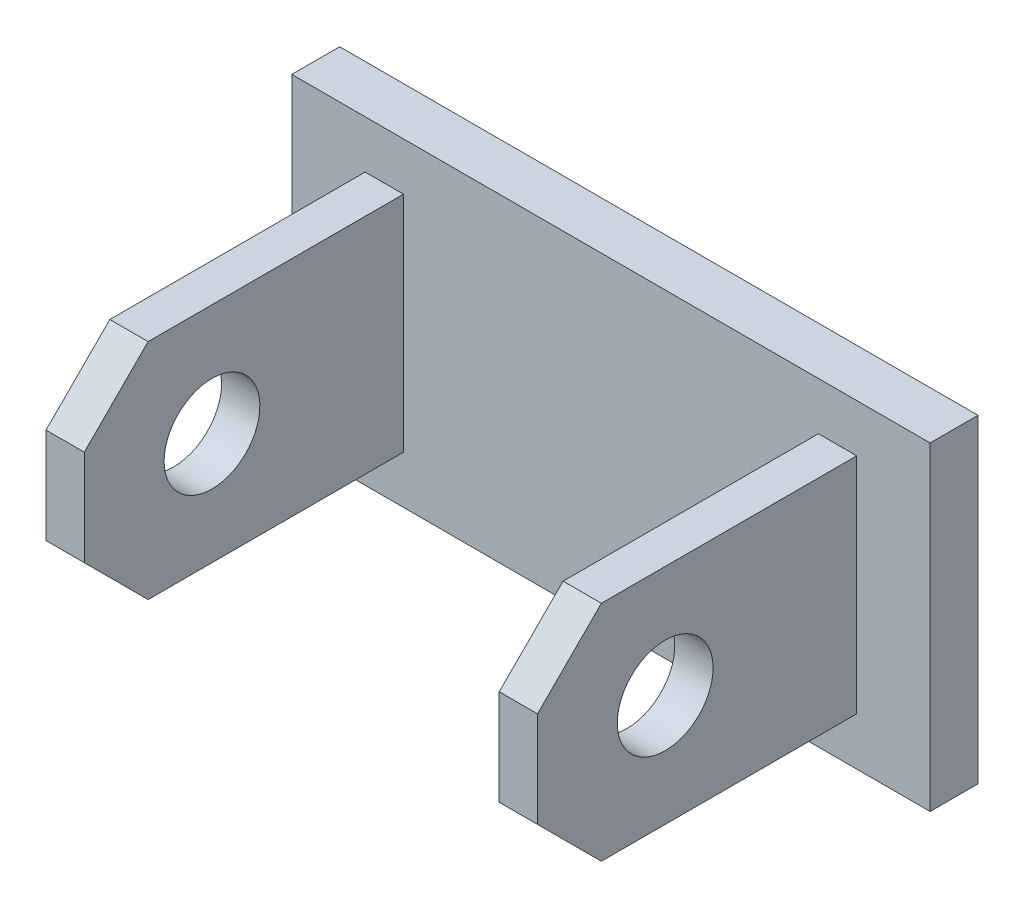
ISO-10303-21;
HEADER;
FILE_DESCRIPTION(('STEP AP214'),'2;1');
FILE_NAME('part.step','',(''),(''),'','','');
FILE_SCHEMA(('AUTOMOTIVE_DESIGN { 1 0 10303 214 1 1 1 1 }'));
ENDSEC;
DATA;
#1=APPLICATION_CONTEXT('core data for automotive mechanical design processes');
#2=APPLICATION_PROTOCOL_DEFINITION('international standard','automotive_design',2000,#1);
#3=PRODUCT_CONTEXT('',#1,'mechanical');
#4=PRODUCT('Part','Part','',(#3));
#5=PRODUCT_RELATED_PRODUCT_CATEGORY('part','',(#4));
#6=PRODUCT_DEFINITION_FORMATION('','',#4);
#7=PRODUCT_DEFINITION_CONTEXT('part definition',#1,'design');
#8=PRODUCT_DEFINITION('design','',#6,#7);
#9=PRODUCT_DEFINITION_SHAPE('','',#8);
#10=(LENGTH_UNIT() NAMED_UNIT(*) SI_UNIT(.MILLI.,.METRE.));
#11=(NAMED_UNIT(*) PLANE_ANGLE_UNIT() SI_UNIT($,.RADIAN.));
#12=(NAMED_UNIT(*) SI_UNIT($,.STERADIAN.) SOLID_ANGLE_UNIT());
#13=UNCERTAINTY_MEASURE_WITH_UNIT(LENGTH_MEASURE(1.E-05),#10,'distance_accuracy_value','');
#14=(GEOMETRIC_REPRESENTATION_CONTEXT(3) GLOBAL_UNCERTAINTY_ASSIGNED_CONTEXT((#13)) GLOBAL_UNIT_ASSIGNED_CONTEXT((#10,
#11,#12)) REPRESENTATION_CONTEXT('',''));
#15=CARTESIAN_POINT('',(0.,0.,0.));
#16=DIRECTION('',(0.,0.,1.));
#17=DIRECTION('',(1.,0.,0.));
#18=AXIS2_PLACEMENT_3D('',#15,#16,#17);
#19=CARTESIAN_POINT('',(77.,35.,115.));
#20=DIRECTION('',(-1.,0.,0.));
#21=DIRECTION('',(0.,1.,0.));
#22=AXIS2_PLACEMENT_3D('',#19,#20,#21);
#23=PLANE('',#22);
#24=CARTESIAN_POINT('',(77.,0.,75.));
#25=DIRECTION('',(-1.,0.,0.));
#26=DIRECTION('',(0.,-1.,0.));
#27=AXIS2_PLACEMENT_3D('',#24,#25,#26);
#28=CIRCLE('',#27,15.);
#29=CARTESIAN_POINT('',(77.,-15.,75.));
#30=VERTEX_POINT('',#29);
#31=EDGE_CURVE('E149',#30,#30,#28,.T.);
#32=ORIENTED_EDGE('',*,*,#31,.T.);
#33=EDGE_LOOP('',(#32));
#34=FACE_BOUND('',#33,.T.);
#35=DIRECTION('',(0.,0.,-1.));
#36=VECTOR('',#35,1.);
#37=CARTESIAN_POINT('',(77.,-35.,115.));
#38=LINE('',#37,#36);
#39=CARTESIAN_POINT('',(77.,-35.,94.9999999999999));
#40=VERTEX_POINT('',#39);
#41=CARTESIAN_POINT('',(77.,-35.,15.));
#42=VERTEX_POINT('',#41);
#43=EDGE_CURVE('E104',#40,#42,#38,.T.);
#44=ORIENTED_EDGE('',*,*,#43,.T.);
#45=DIRECTION('',(0.,-1.,0.));
#46=VECTOR('',#45,1.);
#47=CARTESIAN_POINT('',(77.,35.,15.));
#48=LINE('',#47,#46);
#49=CARTESIAN_POINT('',(77.,35.,15.));
#50=VERTEX_POINT('',#49);
#51=EDGE_CURVE('E110',#50,#42,#48,.T.);
#52=ORIENTED_EDGE('',*,*,#51,.F.);
#53=DIRECTION('',(0.,0.,-1.));
#54=VECTOR('',#53,1.);
#55=CARTESIAN_POINT('',(77.,35.,115.));
#56=LINE('',#55,#54);
#57=CARTESIAN_POINT('',(77.,35.,94.9999999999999));
#58=VERTEX_POINT('',#57);
#59=EDGE_CURVE('E145',#58,#50,#56,.T.);
#60=ORIENTED_EDGE('',*,*,#59,.F.);
#61=DIRECTION('',(0.,0.707106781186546,-0.707106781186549));
#62=VECTOR('',#61,1.);
#63=CARTESIAN_POINT('',(77.,15.,115.));
#64=LINE('',#63,#62);
#65=CARTESIAN_POINT('',(77.,15.,115.));
#66=VERTEX_POINT('',#65);
#67=EDGE_CURVE('E134',#66,#58,#64,.T.);
#68=ORIENTED_EDGE('',*,*,#67,.F.);
#69=DIRECTION('',(0.,-1.,0.));
#70=VECTOR('',#69,1.);
#71=CARTESIAN_POINT('',(77.,35.,115.));
#72=LINE('',#71,#70);
#73=CARTESIAN_POINT('',(77.,-15.,115.));
#74=VERTEX_POINT('',#73);
#75=EDGE_CURVE('E140',#66,#74,#72,.T.);
#76=ORIENTED_EDGE('',*,*,#75,.T.);
#77=DIRECTION('',(0.,0.707106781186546,0.707106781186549));
#78=VECTOR('',#77,1.);
#79=CARTESIAN_POINT('',(77.,-15.,115.));
#80=LINE('',#79,#78);
#81=EDGE_CURVE('E54',#40,#74,#80,.T.);
#82=ORIENTED_EDGE('',*,*,#81,.F.);
#83=EDGE_LOOP('',(#44,#52,#60,#68,#76,#82));
#84=FACE_BOUND('',#83,.T.);
#85=ADVANCED_FACE('F45',(#34,#84),#23,.F.);
#86=CARTESIAN_POINT('',(77.,-35.,115.));
#87=DIRECTION('',(0.,1.,0.));
#88=DIRECTION('',(0.,0.,1.));
#89=AXIS2_PLACEMENT_3D('',#86,#87,#88);
#90=PLANE('',#89);
#91=DIRECTION('',(0.,0.,-1.));
#92=VECTOR('',#91,1.);
#93=CARTESIAN_POINT('',(65.,-35.,115.));
#94=LINE('',#93,#92);
#95=CARTESIAN_POINT('',(65.,-35.,94.9999999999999));
#96=VERTEX_POINT('',#95);
#97=CARTESIAN_POINT('',(65.,-35.,15.));
#98=VERTEX_POINT('',#97);
#99=EDGE_CURVE('E106',#96,#98,#94,.T.);
#100=ORIENTED_EDGE('',*,*,#99,.T.);
#101=DIRECTION('',(-1.,0.,0.));
#102=VECTOR('',#101,1.);
#103=CARTESIAN_POINT('',(77.,-35.,15.));
#104=LINE('',#103,#102);
#105=EDGE_CURVE('E100',#42,#98,#104,.T.);
#106=ORIENTED_EDGE('',*,*,#105,.F.);
#107=ORIENTED_EDGE('',*,*,#43,.F.);
#108=DIRECTION('',(1.,0.,0.));
#109=VECTOR('',#108,1.);
#110=CARTESIAN_POINT('',(77.,-35.,94.9999999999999));
#111=LINE('',#110,#109);
#112=EDGE_CURVE('E67',#96,#40,#111,.T.);
#113=ORIENTED_EDGE('',*,*,#112,.F.);
#114=EDGE_LOOP('',(#100,#106,#107,#113));
#115=FACE_BOUND('',#114,.T.);
#116=ADVANCED_FACE('F102',(#115),#90,.F.);
#117=CARTESIAN_POINT('',(65.,35.,115.));
#118=DIRECTION('',(1.,0.,0.));
#119=DIRECTION('',(0.,0.,1.));
#120=AXIS2_PLACEMENT_3D('',#117,#118,#119);
#121=PLANE('',#120);
#122=CARTESIAN_POINT('',(65.,0.,75.));
#123=DIRECTION('',(-1.,0.,0.));
#124=DIRECTION('',(0.,0.,1.));
#125=AXIS2_PLACEMENT_3D('',#122,#123,#124);
#126=CIRCLE('',#125,15.);
#127=CARTESIAN_POINT('',(65.,0.,90.));
#128=VERTEX_POINT('',#127);
#129=EDGE_CURVE('E49',#128,#128,#126,.T.);
#130=ORIENTED_EDGE('',*,*,#129,.F.);
#131=EDGE_LOOP('',(#130));
#132=FACE_BOUND('',#131,.T.);
#133=DIRECTION('',(0.,1.,0.));
#134=VECTOR('',#133,1.);
#135=CARTESIAN_POINT('',(65.,35.,115.));
#136=LINE('',#135,#134);
#137=CARTESIAN_POINT('',(65.,-15.,115.));
#138=VERTEX_POINT('',#137);
#139=CARTESIAN_POINT('',(65.,15.,115.));
#140=VERTEX_POINT('',#139);
#141=EDGE_CURVE('E142',#138,#140,#136,.T.);
#142=ORIENTED_EDGE('',*,*,#141,.T.);
#143=DIRECTION('',(0.,-0.707106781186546,0.707106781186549));
#144=VECTOR('',#143,1.);
#145=CARTESIAN_POINT('',(65.,15.,115.));
#146=LINE('',#145,#144);
#147=CARTESIAN_POINT('',(65.,35.,94.9999999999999));
#148=VERTEX_POINT('',#147);
#149=EDGE_CURVE('E128',#148,#140,#146,.T.);
#150=ORIENTED_EDGE('',*,*,#149,.F.);
#151=DIRECTION('',(0.,0.,-1.));
#152=VECTOR('',#151,1.);
#153=CARTESIAN_POINT('',(65.,35.,115.));
#154=LINE('',#153,#152);
#155=CARTESIAN_POINT('',(65.,35.,15.));
#156=VERTEX_POINT('',#155);
#157=EDGE_CURVE('E123',#148,#156,#154,.T.);
#158=ORIENTED_EDGE('',*,*,#157,.T.);
#159=DIRECTION('',(0.,1.,0.));
#160=VECTOR('',#159,1.);
#161=CARTESIAN_POINT('',(65.,35.,15.));
#162=LINE('',#161,#160);
#163=EDGE_CURVE('E109',#98,#156,#162,.T.);
#164=ORIENTED_EDGE('',*,*,#163,.F.);
#165=ORIENTED_EDGE('',*,*,#99,.F.);
#166=DIRECTION('',(0.,-0.707106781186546,-0.707106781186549));
#167=VECTOR('',#166,1.);
#168=CARTESIAN_POINT('',(65.,-15.,115.));
#169=LINE('',#168,#167);
#170=EDGE_CURVE('E131',#138,#96,#169,.T.);
#171=ORIENTED_EDGE('',*,*,#170,.F.);
#172=EDGE_LOOP('',(#142,#150,#158,#164,#165,#171));
#173=FACE_BOUND('',#172,.T.);
#174=ADVANCED_FACE('F155',(#132,#173),#121,.F.);
#175=CARTESIAN_POINT('',(77.,35.,115.));
#176=DIRECTION('',(0.,-1.,0.));
#177=DIRECTION('',(0.,0.,-1.));
#178=AXIS2_PLACEMENT_3D('',#175,#176,#177);
#179=PLANE('',#178);
#180=ORIENTED_EDGE('',*,*,#59,.T.);
#181=DIRECTION('',(1.,0.,0.));
#182=VECTOR('',#181,1.);
#183=CARTESIAN_POINT('',(77.,35.,15.));
#184=LINE('',#183,#182);
#185=EDGE_CURVE('E114',#156,#50,#184,.T.);
#186=ORIENTED_EDGE('',*,*,#185,.F.);
#187=ORIENTED_EDGE('',*,*,#157,.F.);
#188=DIRECTION('',(-1.,0.,0.));
#189=VECTOR('',#188,1.);
#190=CARTESIAN_POINT('',(65.,35.,94.9999999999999));
#191=LINE('',#190,#189);
#192=EDGE_CURVE('E12',#58,#148,#191,.T.);
#193=ORIENTED_EDGE('',*,*,#192,.F.);
#194=EDGE_LOOP('',(#180,#186,#187,#193));
#195=FACE_BOUND('',#194,.T.);
#196=ADVANCED_FACE('F156',(#195),#179,.F.);
#197=CARTESIAN_POINT('',(0.,0.,115.));
#198=DIRECTION('',(0.,0.,1.));
#199=DIRECTION('',(-1.,0.,0.));
#200=AXIS2_PLACEMENT_3D('',#197,#198,#199);
#201=PLANE('',#200);
#202=ORIENTED_EDGE('',*,*,#75,.F.);
#203=DIRECTION('',(1.,0.,0.));
#204=VECTOR('',#203,1.);
#205=CARTESIAN_POINT('',(77.,15.,115.));
#206=LINE('',#205,#204);
#207=EDGE_CURVE('E119',#140,#66,#206,.T.);
#208=ORIENTED_EDGE('',*,*,#207,.F.);
#209=ORIENTED_EDGE('',*,*,#141,.F.);
#210=DIRECTION('',(-1.,0.,0.));
#211=VECTOR('',#210,1.);
#212=CARTESIAN_POINT('',(65.,-15.,115.));
#213=LINE('',#212,#211);
#214=EDGE_CURVE('E121',#74,#138,#213,.T.);
#215=ORIENTED_EDGE('',*,*,#214,.F.);
#216=EDGE_LOOP('',(#202,#208,#209,#215));
#217=FACE_BOUND('',#216,.T.);
#218=ADVANCED_FACE('F158',(#217),#201,.T.);
#219=CARTESIAN_POINT('',(0.,0.,15.));
#220=DIRECTION('',(0.,0.,1.));
#221=DIRECTION('',(-1.,0.,0.));
#222=AXIS2_PLACEMENT_3D('',#219,#220,#221);
#223=PLANE('',#222);
#224=ORIENTED_EDGE('',*,*,#51,.T.);
#225=ORIENTED_EDGE('',*,*,#105,.T.);
#226=ORIENTED_EDGE('',*,*,#163,.T.);
#227=ORIENTED_EDGE('',*,*,#185,.T.);
#228=EDGE_LOOP('',(#224,#225,#226,#227));
#229=FACE_BOUND('',#228,.T.);
#230=ADVANCED_FACE('F113',(#229),#223,.F.);
#231=CARTESIAN_POINT('',(0.,-15.,115.));
#232=DIRECTION('',(0.,-0.707106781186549,0.707106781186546));
#233=DIRECTION('',(1.,0.,0.));
#234=AXIS2_PLACEMENT_3D('',#231,#232,#233);
#235=PLANE('',#234);
#236=ORIENTED_EDGE('',*,*,#81,.T.);
#237=ORIENTED_EDGE('',*,*,#214,.T.);
#238=ORIENTED_EDGE('',*,*,#170,.T.);
#239=ORIENTED_EDGE('',*,*,#112,.T.);
#240=EDGE_LOOP('',(#236,#237,#238,#239));
#241=FACE_BOUND('',#240,.T.);
#242=ADVANCED_FACE('F136',(#241),#235,.T.);
#243=CARTESIAN_POINT('',(0.,15.,115.));
#244=DIRECTION('',(0.,0.707106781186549,0.707106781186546));
#245=DIRECTION('',(-1.,0.,0.));
#246=AXIS2_PLACEMENT_3D('',#243,#244,#245);
#247=PLANE('',#246);
#248=ORIENTED_EDGE('',*,*,#149,.T.);
#249=ORIENTED_EDGE('',*,*,#207,.T.);
#250=ORIENTED_EDGE('',*,*,#67,.T.);
#251=ORIENTED_EDGE('',*,*,#192,.T.);
#252=EDGE_LOOP('',(#248,#249,#250,#251));
#253=FACE_BOUND('',#252,.T.);
#254=ADVANCED_FACE('F47',(#253),#247,.T.);
#255=CARTESIAN_POINT('',(-100.,0.,75.));
#256=DIRECTION('',(1.,0.,0.));
#257=DIRECTION('',(0.,-1.,0.));
#258=AXIS2_PLACEMENT_3D('',#255,#256,#257);
#259=CYLINDRICAL_SURFACE('',#258,15.);
#260=ORIENTED_EDGE('',*,*,#31,.F.);
#261=EDGE_LOOP('',(#260));
#262=FACE_BOUND('',#261,.T.);
#263=ORIENTED_EDGE('',*,*,#129,.T.);
#264=EDGE_LOOP('',(#263));
#265=FACE_BOUND('',#264,.T.);
#266=ADVANCED_FACE('F181',(#262,#265),#259,.F.);
#267=CLOSED_SHELL('',(#85,#116,#174,#196,#218,#230,#242,#254,#266));
#268=MANIFOLD_SOLID_BREP('B2',#267);
#269=CARTESIAN_POINT('',(-77.,35.,115.));
#270=DIRECTION('',(1.,0.,0.));
#271=DIRECTION('',(0.,1.,0.));
#272=AXIS2_PLACEMENT_3D('',#269,#270,#271);
#273=PLANE('',#272);
#274=CARTESIAN_POINT('',(-77.,0.,75.));
#275=DIRECTION('',(-1.,0.,0.));
#276=DIRECTION('',(0.,-1.,0.));
#277=AXIS2_PLACEMENT_3D('',#274,#275,#276);
#278=CIRCLE('',#277,15.);
#279=CARTESIAN_POINT('',(-77.,-15.,75.));
#280=VERTEX_POINT('',#279);
#281=EDGE_CURVE('E324',#280,#280,#278,.T.);
#282=ORIENTED_EDGE('',*,*,#281,.F.);
#283=EDGE_LOOP('',(#282));
#284=FACE_BOUND('',#283,.T.);
#285=DIRECTION('',(0.,0.,-1.));
#286=VECTOR('',#285,1.);
#287=CARTESIAN_POINT('',(-77.,-35.,115.));
#288=LINE('',#287,#286);
#289=CARTESIAN_POINT('',(-77.,-35.,94.9999999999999));
#290=VERTEX_POINT('',#289);
#291=CARTESIAN_POINT('',(-77.,-35.,15.));
#292=VERTEX_POINT('',#291);
#293=EDGE_CURVE('E302',#290,#292,#288,.T.);
#294=ORIENTED_EDGE('',*,*,#293,.F.);
#295=DIRECTION('',(0.,0.707106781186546,0.707106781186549));
#296=VECTOR('',#295,1.);
#297=CARTESIAN_POINT('',(-77.,-15.,115.));
#298=LINE('',#297,#296);
#299=CARTESIAN_POINT('',(-77.,-15.,115.));
#300=VERTEX_POINT('',#299);
#301=EDGE_CURVE('E259',#290,#300,#298,.T.);
#302=ORIENTED_EDGE('',*,*,#301,.T.);
#303=DIRECTION('',(0.,-1.,0.));
#304=VECTOR('',#303,1.);
#305=CARTESIAN_POINT('',(-77.,35.,115.));
#306=LINE('',#305,#304);
#307=CARTESIAN_POINT('',(-77.,15.,115.));
#308=VERTEX_POINT('',#307);
#309=EDGE_CURVE('E332',#308,#300,#306,.T.);
#310=ORIENTED_EDGE('',*,*,#309,.F.);
#311=DIRECTION('',(0.,0.707106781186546,-0.707106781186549));
#312=VECTOR('',#311,1.);
#313=CARTESIAN_POINT('',(-77.,15.,115.));
#314=LINE('',#313,#312);
#315=CARTESIAN_POINT('',(-77.,35.,94.9999999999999));
#316=VERTEX_POINT('',#315);
#317=EDGE_CURVE('E266',#308,#316,#314,.T.);
#318=ORIENTED_EDGE('',*,*,#317,.T.);
#319=DIRECTION('',(0.,0.,-1.));
#320=VECTOR('',#319,1.);
#321=CARTESIAN_POINT('',(-77.,35.,115.));
#322=LINE('',#321,#320);
#323=CARTESIAN_POINT('',(-77.,35.,15.));
#324=VERTEX_POINT('',#323);
#325=EDGE_CURVE('E320',#316,#324,#322,.T.);
#326=ORIENTED_EDGE('',*,*,#325,.T.);
#327=DIRECTION('',(0.,-1.,0.));
#328=VECTOR('',#327,1.);
#329=CARTESIAN_POINT('',(-77.,35.,15.));
#330=LINE('',#329,#328);
#331=EDGE_CURVE('E316',#324,#292,#330,.T.);
#332=ORIENTED_EDGE('',*,*,#331,.T.);
#333=EDGE_LOOP('',(#294,#302,#310,#318,#326,#332));
#334=FACE_BOUND('',#333,.T.);
#335=ADVANCED_FACE('F250',(#284,#334),#273,.F.);
#336=CARTESIAN_POINT('',(-77.,-35.,115.));
#337=DIRECTION('',(0.,1.,0.));
#338=DIRECTION('',(0.,0.,1.));
#339=AXIS2_PLACEMENT_3D('',#336,#337,#338);
#340=PLANE('',#339);
#341=DIRECTION('',(0.,0.,-1.));
#342=VECTOR('',#341,1.);
#343=CARTESIAN_POINT('',(-65.,-35.,115.));
#344=LINE('',#343,#342);
#345=CARTESIAN_POINT('',(-65.,-35.,94.9999999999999));
#346=VERTEX_POINT('',#345);
#347=CARTESIAN_POINT('',(-65.,-35.,15.));
#348=VERTEX_POINT('',#347);
#349=EDGE_CURVE('E310',#346,#348,#344,.T.);
#350=ORIENTED_EDGE('',*,*,#349,.F.);
#351=DIRECTION('',(-1.,0.,0.));
#352=VECTOR('',#351,1.);
#353=CARTESIAN_POINT('',(-77.,-35.,94.9999999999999));
#354=LINE('',#353,#352);
#355=EDGE_CURVE('E274',#346,#290,#354,.T.);
#356=ORIENTED_EDGE('',*,*,#355,.T.);
#357=ORIENTED_EDGE('',*,*,#293,.T.);
#358=DIRECTION('',(1.,0.,0.));
#359=VECTOR('',#358,1.);
#360=CARTESIAN_POINT('',(-77.,-35.,15.));
#361=LINE('',#360,#359);
#362=EDGE_CURVE('E305',#292,#348,#361,.T.);
#363=ORIENTED_EDGE('',*,*,#362,.T.);
#364=EDGE_LOOP('',(#350,#356,#357,#363));
#365=FACE_BOUND('',#364,.T.);
#366=ADVANCED_FACE('F304',(#365),#340,.F.);
#367=CARTESIAN_POINT('',(-65.,35.,115.));
#368=DIRECTION('',(-1.,0.,0.));
#369=DIRECTION('',(0.,0.,1.));
#370=AXIS2_PLACEMENT_3D('',#367,#368,#369);
#371=PLANE('',#370);
#372=CARTESIAN_POINT('',(-65.,0.,75.));
#373=DIRECTION('',(-1.,0.,0.));
#374=DIRECTION('',(0.,0.,1.));
#375=AXIS2_PLACEMENT_3D('',#372,#373,#374);
#376=CIRCLE('',#375,15.);
#377=CARTESIAN_POINT('',(-65.,0.,90.));
#378=VERTEX_POINT('',#377);
#379=EDGE_CURVE('E254',#378,#378,#376,.T.);
#380=ORIENTED_EDGE('',*,*,#379,.T.);
#381=EDGE_LOOP('',(#380));
#382=FACE_BOUND('',#381,.T.);
#383=DIRECTION('',(0.,1.,0.));
#384=VECTOR('',#383,1.);
#385=CARTESIAN_POINT('',(-65.,35.,115.));
#386=LINE('',#385,#384);
#387=CARTESIAN_POINT('',(-65.,-15.,115.));
#388=VERTEX_POINT('',#387);
#389=CARTESIAN_POINT('',(-65.,15.,115.));
#390=VERTEX_POINT('',#389);
#391=EDGE_CURVE('E326',#388,#390,#386,.T.);
#392=ORIENTED_EDGE('',*,*,#391,.F.);
#393=DIRECTION('',(0.,-0.707106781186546,-0.707106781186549));
#394=VECTOR('',#393,1.);
#395=CARTESIAN_POINT('',(-65.,-15.,115.));
#396=LINE('',#395,#394);
#397=EDGE_CURVE('E344',#388,#346,#396,.T.);
#398=ORIENTED_EDGE('',*,*,#397,.T.);
#399=ORIENTED_EDGE('',*,*,#349,.T.);
#400=DIRECTION('',(0.,1.,0.));
#401=VECTOR('',#400,1.);
#402=CARTESIAN_POINT('',(-65.,35.,15.));
#403=LINE('',#402,#401);
#404=CARTESIAN_POINT('',(-65.,35.,15.));
#405=VERTEX_POINT('',#404);
#406=EDGE_CURVE('E318',#348,#405,#403,.T.);
#407=ORIENTED_EDGE('',*,*,#406,.T.);
#408=DIRECTION('',(0.,0.,-1.));
#409=VECTOR('',#408,1.);
#410=CARTESIAN_POINT('',(-65.,35.,115.));
#411=LINE('',#410,#409);
#412=CARTESIAN_POINT('',(-65.,35.,94.9999999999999));
#413=VERTEX_POINT('',#412);
#414=EDGE_CURVE('E334',#413,#405,#411,.T.);
#415=ORIENTED_EDGE('',*,*,#414,.F.);
#416=DIRECTION('',(0.,-0.707106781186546,0.707106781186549));
#417=VECTOR('',#416,1.);
#418=CARTESIAN_POINT('',(-65.,15.,115.));
#419=LINE('',#418,#417);
#420=EDGE_CURVE('E342',#413,#390,#419,.T.);
#421=ORIENTED_EDGE('',*,*,#420,.T.);
#422=EDGE_LOOP('',(#392,#398,#399,#407,#415,#421));
#423=FACE_BOUND('',#422,.T.);
#424=ADVANCED_FACE('F358',(#382,#423),#371,.F.);
#425=CARTESIAN_POINT('',(-77.,35.,115.));
#426=DIRECTION('',(0.,-1.,0.));
#427=DIRECTION('',(0.,0.,-1.));
#428=AXIS2_PLACEMENT_3D('',#425,#426,#427);
#429=PLANE('',#428);
#430=ORIENTED_EDGE('',*,*,#325,.F.);
#431=DIRECTION('',(1.,0.,0.));
#432=VECTOR('',#431,1.);
#433=CARTESIAN_POINT('',(-65.,35.,94.9999999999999));
#434=LINE('',#433,#432);
#435=EDGE_CURVE('E43',#316,#413,#434,.T.);
#436=ORIENTED_EDGE('',*,*,#435,.T.);
#437=ORIENTED_EDGE('',*,*,#414,.T.);
#438=DIRECTION('',(-1.,0.,0.));
#439=VECTOR('',#438,1.);
#440=CARTESIAN_POINT('',(-77.,35.,15.));
#441=LINE('',#440,#439);
#442=EDGE_CURVE('E330',#405,#324,#441,.T.);
#443=ORIENTED_EDGE('',*,*,#442,.T.);
#444=EDGE_LOOP('',(#430,#436,#437,#443));
#445=FACE_BOUND('',#444,.T.);
#446=ADVANCED_FACE('F364',(#445),#429,.F.);
#447=CARTESIAN_POINT('',(0.,0.,115.));
#448=DIRECTION('',(0.,0.,1.));
#449=DIRECTION('',(1.,0.,0.));
#450=AXIS2_PLACEMENT_3D('',#447,#448,#449);
#451=PLANE('',#450);
#452=ORIENTED_EDGE('',*,*,#309,.T.);
#453=DIRECTION('',(1.,0.,0.));
#454=VECTOR('',#453,1.);
#455=CARTESIAN_POINT('',(-65.,-15.,115.));
#456=LINE('',#455,#454);
#457=EDGE_CURVE('E339',#300,#388,#456,.T.);
#458=ORIENTED_EDGE('',*,*,#457,.T.);
#459=ORIENTED_EDGE('',*,*,#391,.T.);
#460=DIRECTION('',(-1.,0.,0.));
#461=VECTOR('',#460,1.);
#462=CARTESIAN_POINT('',(-77.,15.,115.));
#463=LINE('',#462,#461);
#464=EDGE_CURVE('E309',#390,#308,#463,.T.);
#465=ORIENTED_EDGE('',*,*,#464,.T.);
#466=EDGE_LOOP('',(#452,#458,#459,#465));
#467=FACE_BOUND('',#466,.T.);
#468=ADVANCED_FACE('F352',(#467),#451,.T.);
#469=CARTESIAN_POINT('',(0.,0.,15.));
#470=DIRECTION('',(0.,0.,1.));
#471=DIRECTION('',(1.,0.,0.));
#472=AXIS2_PLACEMENT_3D('',#469,#470,#471);
#473=PLANE('',#472);
#474=ORIENTED_EDGE('',*,*,#331,.F.);
#475=ORIENTED_EDGE('',*,*,#442,.F.);
#476=ORIENTED_EDGE('',*,*,#406,.F.);
#477=ORIENTED_EDGE('',*,*,#362,.F.);
#478=EDGE_LOOP('',(#474,#475,#476,#477));
#479=FACE_BOUND('',#478,.T.);
#480=ADVANCED_FACE('F314',(#479),#473,.F.);
#481=CARTESIAN_POINT('',(0.,-15.,115.));
#482=DIRECTION('',(0.,-0.707106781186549,0.707106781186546));
#483=DIRECTION('',(-1.,0.,0.));
#484=AXIS2_PLACEMENT_3D('',#481,#482,#483);
#485=PLANE('',#484);
#486=ORIENTED_EDGE('',*,*,#301,.F.);
#487=ORIENTED_EDGE('',*,*,#355,.F.);
#488=ORIENTED_EDGE('',*,*,#397,.F.);
#489=ORIENTED_EDGE('',*,*,#457,.F.);
#490=EDGE_LOOP('',(#486,#487,#488,#489));
#491=FACE_BOUND('',#490,.T.);
#492=ADVANCED_FACE('F356',(#491),#485,.T.);
#493=CARTESIAN_POINT('',(0.,15.,115.));
#494=DIRECTION('',(0.,0.707106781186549,0.707106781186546));
#495=DIRECTION('',(1.,0.,0.));
#496=AXIS2_PLACEMENT_3D('',#493,#494,#495);
#497=PLANE('',#496);
#498=ORIENTED_EDGE('',*,*,#420,.F.);
#499=ORIENTED_EDGE('',*,*,#435,.F.);
#500=ORIENTED_EDGE('',*,*,#317,.F.);
#501=ORIENTED_EDGE('',*,*,#464,.F.);
#502=EDGE_LOOP('',(#498,#499,#500,#501));
#503=FACE_BOUND('',#502,.T.);
#504=ADVANCED_FACE('F252',(#503),#497,.T.);
#505=CARTESIAN_POINT('',(100.,0.,75.));
#506=DIRECTION('',(-1.,0.,0.));
#507=DIRECTION('',(0.,-1.,0.));
#508=AXIS2_PLACEMENT_3D('',#505,#506,#507);
#509=CYLINDRICAL_SURFACE('',#508,15.);
#510=ORIENTED_EDGE('',*,*,#281,.T.);
#511=EDGE_LOOP('',(#510));
#512=FACE_BOUND('',#511,.T.);
#513=ORIENTED_EDGE('',*,*,#379,.F.);
#514=EDGE_LOOP('',(#513));
#515=FACE_BOUND('',#514,.T.);
#516=ADVANCED_FACE('F388',(#512,#515),#509,.F.);
#517=CLOSED_SHELL('',(#335,#366,#424,#446,#468,#480,#492,#504,#516));
#518=MANIFOLD_SOLID_BREP('B6',#517);
#519=CARTESIAN_POINT('',(-100.,-50.,15.));
#520=DIRECTION('',(1.,0.,0.));
#521=DIRECTION('',(0.,0.,-1.));
#522=AXIS2_PLACEMENT_3D('',#519,#520,#521);
#523=PLANE('',#522);
#524=DIRECTION('',(0.,-1.,0.));
#525=VECTOR('',#524,1.);
#526=CARTESIAN_POINT('',(-100.,-50.,0.));
#527=LINE('',#526,#525);
#528=CARTESIAN_POINT('',(-100.,50.,0.));
#529=VERTEX_POINT('',#528);
#530=CARTESIAN_POINT('',(-100.,-50.,0.));
#531=VERTEX_POINT('',#530);
#532=EDGE_CURVE('E509',#529,#531,#527,.T.);
#533=ORIENTED_EDGE('',*,*,#532,.T.);
#534=DIRECTION('',(0.,0.,-1.));
#535=VECTOR('',#534,1.);
#536=CARTESIAN_POINT('',(-100.,-50.,15.));
#537=LINE('',#536,#535);
#538=CARTESIAN_POINT('',(-100.,-50.,15.));
#539=VERTEX_POINT('',#538);
#540=EDGE_CURVE('E248',#539,#531,#537,.T.);
#541=ORIENTED_EDGE('',*,*,#540,.F.);
#542=DIRECTION('',(0.,-1.,0.));
#543=VECTOR('',#542,1.);
#544=CARTESIAN_POINT('',(-100.,-50.,15.));
#545=LINE('',#544,#543);
#546=CARTESIAN_POINT('',(-100.,50.,15.));
#547=VERTEX_POINT('',#546);
#548=EDGE_CURVE('E497',#547,#539,#545,.T.);
#549=ORIENTED_EDGE('',*,*,#548,.F.);
#550=DIRECTION('',(0.,0.,-1.));
#551=VECTOR('',#550,1.);
#552=CARTESIAN_POINT('',(-100.,50.,15.));
#553=LINE('',#552,#551);
#554=EDGE_CURVE('E505',#547,#529,#553,.T.);
#555=ORIENTED_EDGE('',*,*,#554,.T.);
#556=EDGE_LOOP('',(#533,#541,#549,#555));
#557=FACE_BOUND('',#556,.T.);
#558=ADVANCED_FACE('F446',(#557),#523,.F.);
#559=CARTESIAN_POINT('',(100.,-50.,15.));
#560=DIRECTION('',(0.,1.,0.));
#561=DIRECTION('',(-1.,0.,0.));
#562=AXIS2_PLACEMENT_3D('',#559,#560,#561);
#563=PLANE('',#562);
#564=DIRECTION('',(1.,0.,0.));
#565=VECTOR('',#564,1.);
#566=CARTESIAN_POINT('',(100.,-50.,0.));
#567=LINE('',#566,#565);
#568=CARTESIAN_POINT('',(100.,-50.,0.));
#569=VERTEX_POINT('',#568);
#570=EDGE_CURVE('E501',#531,#569,#567,.T.);
#571=ORIENTED_EDGE('',*,*,#570,.T.);
#572=DIRECTION('',(0.,0.,-1.));
#573=VECTOR('',#572,1.);
#574=CARTESIAN_POINT('',(100.,-50.,15.));
#575=LINE('',#574,#573);
#576=CARTESIAN_POINT('',(100.,-50.,15.));
#577=VERTEX_POINT('',#576);
#578=EDGE_CURVE('E454',#577,#569,#575,.T.);
#579=ORIENTED_EDGE('',*,*,#578,.F.);
#580=DIRECTION('',(1.,0.,0.));
#581=VECTOR('',#580,1.);
#582=CARTESIAN_POINT('',(100.,-50.,15.));
#583=LINE('',#582,#581);
#584=EDGE_CURVE('E492',#539,#577,#583,.T.);
#585=ORIENTED_EDGE('',*,*,#584,.F.);
#586=ORIENTED_EDGE('',*,*,#540,.T.);
#587=EDGE_LOOP('',(#571,#579,#585,#586));
#588=FACE_BOUND('',#587,.T.);
#589=ADVANCED_FACE('F500',(#588),#563,.F.);
#590=CARTESIAN_POINT('',(100.,-50.,15.));
#591=DIRECTION('',(-1.,0.,0.));
#592=DIRECTION('',(0.,0.,1.));
#593=AXIS2_PLACEMENT_3D('',#590,#591,#592);
#594=PLANE('',#593);
#595=DIRECTION('',(0.,1.,0.));
#596=VECTOR('',#595,1.);
#597=CARTESIAN_POINT('',(100.,-50.,0.));
#598=LINE('',#597,#596);
#599=CARTESIAN_POINT('',(100.,50.,0.));
#600=VERTEX_POINT('',#599);
#601=EDGE_CURVE('E479',#569,#600,#598,.T.);
#602=ORIENTED_EDGE('',*,*,#601,.T.);
#603=DIRECTION('',(0.,0.,-1.));
#604=VECTOR('',#603,1.);
#605=CARTESIAN_POINT('',(100.,50.,15.));
#606=LINE('',#605,#604);
#607=CARTESIAN_POINT('',(100.,50.,15.));
#608=VERTEX_POINT('',#607);
#609=EDGE_CURVE('E502',#608,#600,#606,.T.);
#610=ORIENTED_EDGE('',*,*,#609,.F.);
#611=DIRECTION('',(0.,1.,0.));
#612=VECTOR('',#611,1.);
#613=CARTESIAN_POINT('',(100.,-50.,15.));
#614=LINE('',#613,#612);
#615=EDGE_CURVE('E495',#577,#608,#614,.T.);
#616=ORIENTED_EDGE('',*,*,#615,.F.);
#617=ORIENTED_EDGE('',*,*,#578,.T.);
#618=EDGE_LOOP('',(#602,#610,#616,#617));
#619=FACE_BOUND('',#618,.T.);
#620=ADVANCED_FACE('F503',(#619),#594,.F.);
#621=CARTESIAN_POINT('',(100.,50.,15.));
#622=DIRECTION('',(0.,-1.,0.));
#623=DIRECTION('',(1.,0.,0.));
#624=AXIS2_PLACEMENT_3D('',#621,#622,#623);
#625=PLANE('',#624);
#626=DIRECTION('',(-1.,0.,0.));
#627=VECTOR('',#626,1.);
#628=CARTESIAN_POINT('',(100.,50.,0.));
#629=LINE('',#628,#627);
#630=EDGE_CURVE('E485',#600,#529,#629,.T.);
#631=ORIENTED_EDGE('',*,*,#630,.T.);
#632=ORIENTED_EDGE('',*,*,#554,.F.);
#633=DIRECTION('',(-1.,0.,0.));
#634=VECTOR('',#633,1.);
#635=CARTESIAN_POINT('',(100.,50.,15.));
#636=LINE('',#635,#634);
#637=EDGE_CURVE('E462',#608,#547,#636,.T.);
#638=ORIENTED_EDGE('',*,*,#637,.F.);
#639=ORIENTED_EDGE('',*,*,#609,.T.);
#640=EDGE_LOOP('',(#631,#632,#638,#639));
#641=FACE_BOUND('',#640,.T.);
#642=ADVANCED_FACE('F516',(#641),#625,.F.);
#643=CARTESIAN_POINT('',(0.,0.,15.));
#644=DIRECTION('',(0.,0.,1.));
#645=DIRECTION('',(1.,0.,0.));
#646=AXIS2_PLACEMENT_3D('',#643,#644,#645);
#647=PLANE('',#646);
#648=ORIENTED_EDGE('',*,*,#548,.T.);
#649=ORIENTED_EDGE('',*,*,#584,.T.);
#650=ORIENTED_EDGE('',*,*,#615,.T.);
#651=ORIENTED_EDGE('',*,*,#637,.T.);
#652=EDGE_LOOP('',(#648,#649,#650,#651));
#653=FACE_BOUND('',#652,.T.);
#654=ADVANCED_FACE('F493',(#653),#647,.T.);
#655=CARTESIAN_POINT('',(0.,0.,0.));
#656=DIRECTION('',(0.,0.,1.));
#657=DIRECTION('',(1.,0.,0.));
#658=AXIS2_PLACEMENT_3D('',#655,#656,#657);
#659=PLANE('',#658);
#660=ORIENTED_EDGE('',*,*,#532,.F.);
#661=ORIENTED_EDGE('',*,*,#630,.F.);
#662=ORIENTED_EDGE('',*,*,#601,.F.);
#663=ORIENTED_EDGE('',*,*,#570,.F.);
#664=EDGE_LOOP('',(#660,#661,#662,#663));
#665=FACE_BOUND('',#664,.T.);
#666=ADVANCED_FACE('F519',(#665),#659,.F.);
#667=CLOSED_SHELL('',(#558,#589,#620,#642,#654,#666));
#668=MANIFOLD_SOLID_BREP('B37',#667);
#669=ADVANCED_BREP_SHAPE_REPRESENTATION('',(#18,#268,#518,#668),#14);
#670=SHAPE_DEFINITION_REPRESENTATION(#9,#669);
ENDSEC;
END-ISO-10303-21;
